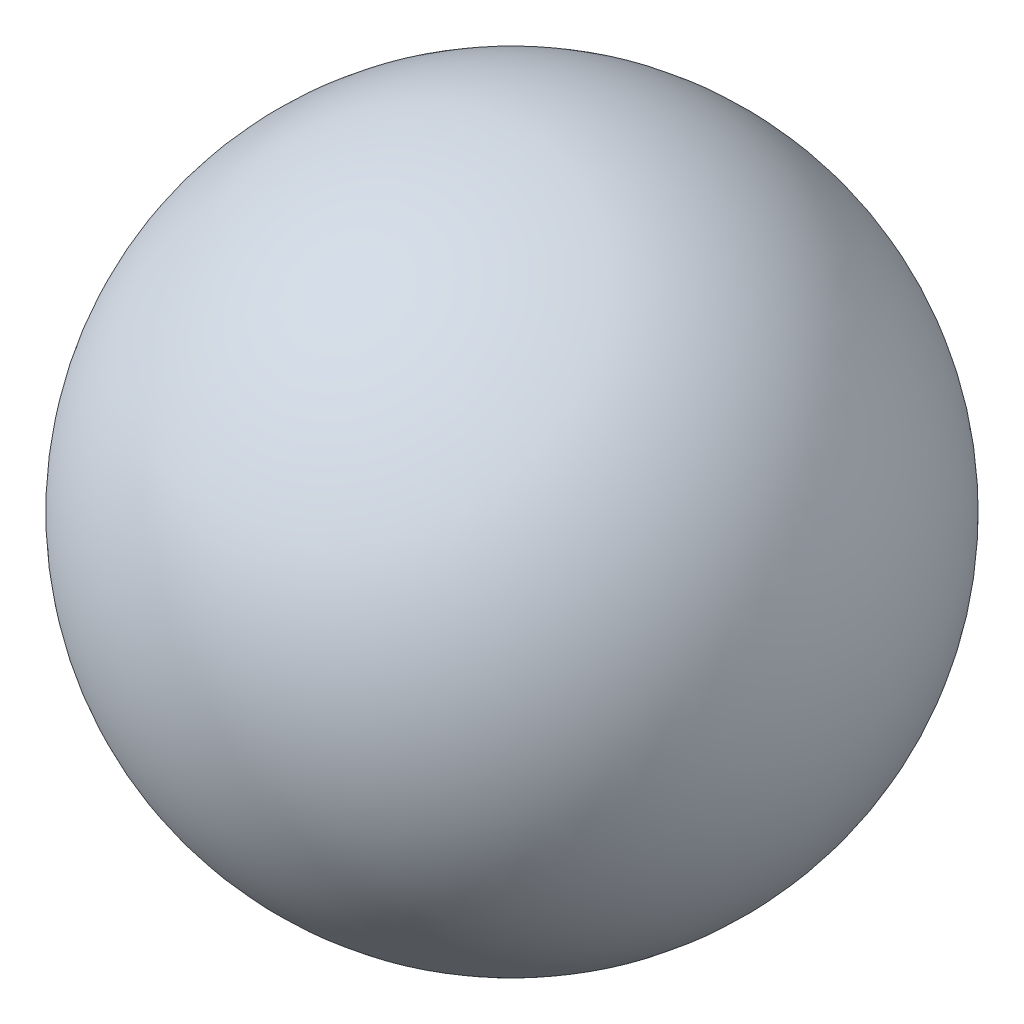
ISO-10303-21;
HEADER;
FILE_DESCRIPTION(('STEP AP214'),'2;1');
FILE_NAME('part.step','',(''),(''),'','','');
FILE_SCHEMA(('AUTOMOTIVE_DESIGN { 1 0 10303 214 1 1 1 1 }'));
ENDSEC;
DATA;
#1=APPLICATION_CONTEXT('core data for automotive mechanical design processes');
#2=APPLICATION_PROTOCOL_DEFINITION('international standard','automotive_design',2000,#1);
#3=PRODUCT_CONTEXT('',#1,'mechanical');
#4=PRODUCT('Part','Part','',(#3));
#5=PRODUCT_RELATED_PRODUCT_CATEGORY('part','',(#4));
#6=PRODUCT_DEFINITION_FORMATION('','',#4);
#7=PRODUCT_DEFINITION_CONTEXT('part definition',#1,'design');
#8=PRODUCT_DEFINITION('design','',#6,#7);
#9=PRODUCT_DEFINITION_SHAPE('','',#8);
#10=(LENGTH_UNIT() NAMED_UNIT(*) SI_UNIT(.MILLI.,.METRE.));
#11=(NAMED_UNIT(*) PLANE_ANGLE_UNIT() SI_UNIT($,.RADIAN.));
#12=(NAMED_UNIT(*) SI_UNIT($,.STERADIAN.) SOLID_ANGLE_UNIT());
#13=UNCERTAINTY_MEASURE_WITH_UNIT(LENGTH_MEASURE(1.E-05),#10,'distance_accuracy_value','');
#14=(GEOMETRIC_REPRESENTATION_CONTEXT(3) GLOBAL_UNCERTAINTY_ASSIGNED_CONTEXT((#13)) GLOBAL_UNIT_ASSIGNED_CONTEXT((#10,
#11,#12)) REPRESENTATION_CONTEXT('',''));
#15=CARTESIAN_POINT('',(0.,0.,0.));
#16=DIRECTION('',(0.,0.,1.));
#17=DIRECTION('',(1.,0.,0.));
#18=AXIS2_PLACEMENT_3D('',#15,#16,#17);
#19=CARTESIAN_POINT('',(0.,0.,0.));
#20=DIRECTION('',(0.,-1.,0.));
#21=DIRECTION('',(1.,0.,0.));
#22=AXIS2_PLACEMENT_3D('',#19,#20,#21);
#23=SPHERICAL_SURFACE('',#22,15.24);
#24=CARTESIAN_POINT('',(0.,-15.24,0.));
#25=VERTEX_POINT('',#24);
#26=VERTEX_LOOP('',#25);
#27=FACE_BOUND('',#26,.T.);
#28=ADVANCED_FACE('F29',(#27),#23,.T.);
#29=CLOSED_SHELL('',(#28));
#30=CARTESIAN_POINT('',(0.,0.,0.));
#31=DIRECTION('',(0.,-1.,0.));
#32=DIRECTION('',(1.,0.,0.));
#33=AXIS2_PLACEMENT_3D('',#30,#31,#32);
#34=SPHERICAL_SURFACE('',#33,12.7);
#35=CARTESIAN_POINT('',(0.,-12.7,0.));
#36=VERTEX_POINT('',#35);
#37=VERTEX_LOOP('',#36);
#38=FACE_BOUND('',#37,.T.);
#39=ADVANCED_FACE('F42',(#38),#34,.F.);
#40=CLOSED_SHELL('',(#39));
#41=ORIENTED_CLOSED_SHELL('',*,#40,.T.);
#42=BREP_WITH_VOIDS('B2',#29,(#41));
#43=ADVANCED_BREP_SHAPE_REPRESENTATION('',(#18,#42),#14);
#44=SHAPE_DEFINITION_REPRESENTATION(#9,#43);
ENDSEC;
END-ISO-10303-21;
